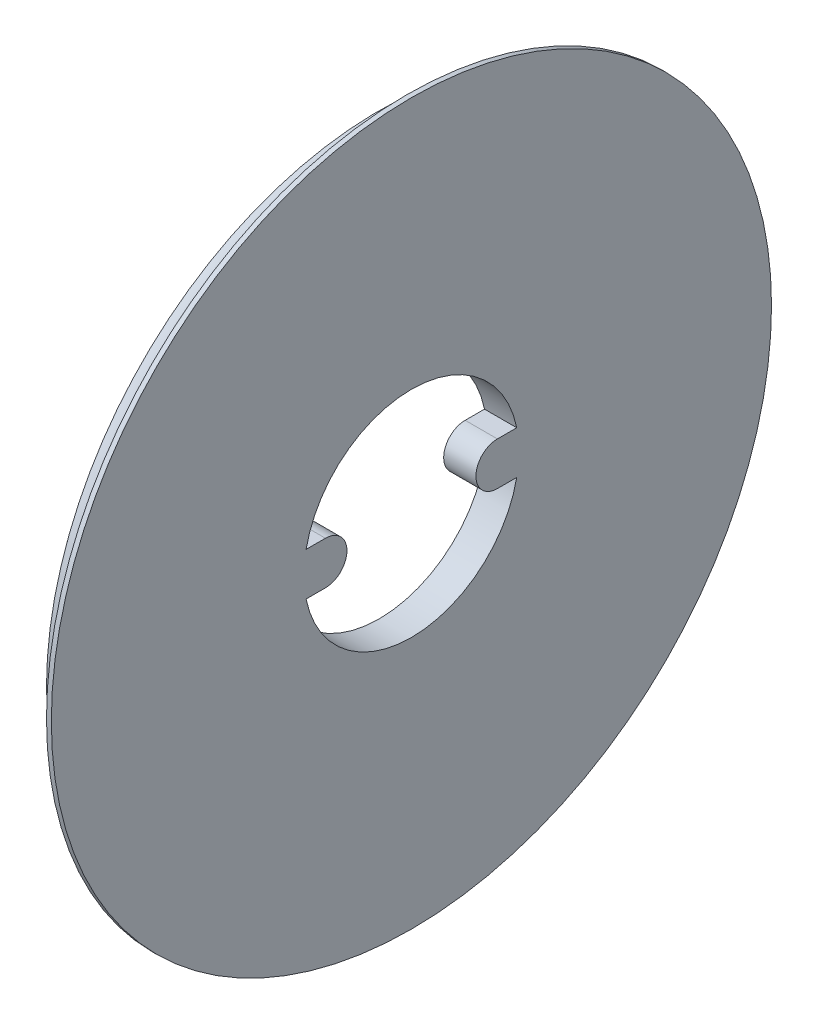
from build123d import *

# Parameters (mm, degrees)
ENL_V_MAT_EXTRU_1_DEPTH = 6
ESQUISSE6_R             = 1.1
ENL_V_MAT_EXTRU_2_DEPTH = 4


with BuildPart() as part:
    # Esquisse3 → R_volution1 (revolve)
    with BuildSketch(Plane.XY, mode=Mode.PRIVATE) as r_volution1_sk:
        with BuildLine():
            Line((6, 61.9), (6, 0))
            Line((6, 0), (12, 0))
            Line((12, 0), (12, 67))
            Line((12, 67), (11.1, 67))
            ThreePointArc((11.1, 67), (9.606244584, 63.393755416), (6, 61.9))
        make_face()
    revolve(r_volution1_sk.sketch.rotate(Axis((-19.078214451, 0, 0), (1, 0, 0)), 90), axis=Axis((-19.078214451, 0, 0), (1, 0, 0)))

    # Esquisse5 → Enl_v. mat.-Extru.1 (cut)
    with BuildSketch(Plane.ZY.offset(-6)):
        with BuildLine():
            Line((-19.595917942, 4), (-16, 4))
            ThreePointArc((-16, 4), (-12, 0), (-16, -4))
            Line((-16, -4), (-19.595917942, -4))
            ThreePointArc((-19.595917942, -4), (0, -20), (19.595917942, -4))
            Line((19.595917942, -4), (16, -4))
            ThreePointArc((16, -4), (12, 0), (16, 4))
            Line((16, 4), (19.595917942, 4))
            ThreePointArc((19.595917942, 4), (0, 20), (-19.595917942, 4))
        make_face()
    extrude(amount=-ENL_V_MAT_EXTRU_1_DEPTH, mode=Mode.SUBTRACT)

    # Esquisse6 → Enl_v. mat.-Extru.2 (cut)
    with BuildSketch(Plane.ZY.offset(-6)):
        with Locations((0, 30)):
            Circle(ESQUISSE6_R)
        with Locations((25.980762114, 15)):
            Circle(ESQUISSE6_R)
        with Locations((25.980762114, -15)):
            Circle(ESQUISSE6_R)
        with Locations((0, -30)):
            Circle(ESQUISSE6_R)
        with Locations((-25.980762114, -15)):
            Circle(ESQUISSE6_R)
        with Locations((-25.980762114, 15)):
            Circle(ESQUISSE6_R)
    extrude(amount=-ENL_V_MAT_EXTRU_2_DEPTH, mode=Mode.SUBTRACT)


solid = part.part
